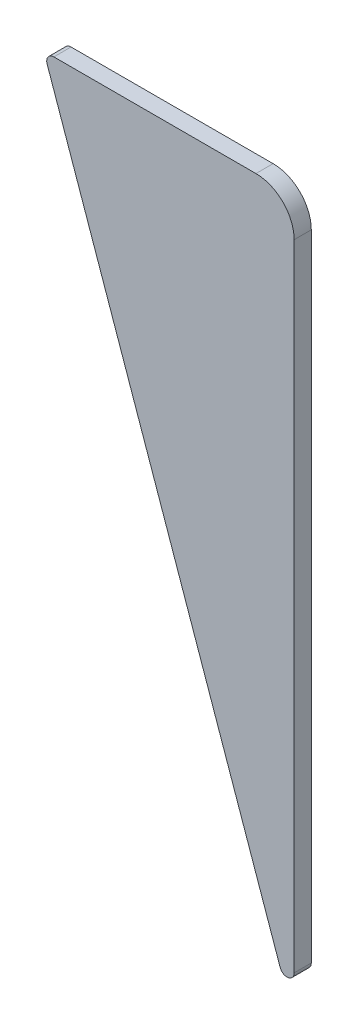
ISO-10303-21;
HEADER;
FILE_DESCRIPTION(('STEP AP214'),'2;1');
FILE_NAME('part.step','',(''),(''),'','','');
FILE_SCHEMA(('AUTOMOTIVE_DESIGN { 1 0 10303 214 1 1 1 1 }'));
ENDSEC;
DATA;
#1=APPLICATION_CONTEXT('core data for automotive mechanical design processes');
#2=APPLICATION_PROTOCOL_DEFINITION('international standard','automotive_design',2000,#1);
#3=PRODUCT_CONTEXT('',#1,'mechanical');
#4=PRODUCT('Part','Part','',(#3));
#5=PRODUCT_RELATED_PRODUCT_CATEGORY('part','',(#4));
#6=PRODUCT_DEFINITION_FORMATION('','',#4);
#7=PRODUCT_DEFINITION_CONTEXT('part definition',#1,'design');
#8=PRODUCT_DEFINITION('design','',#6,#7);
#9=PRODUCT_DEFINITION_SHAPE('','',#8);
#10=(LENGTH_UNIT() NAMED_UNIT(*) SI_UNIT(.MILLI.,.METRE.));
#11=(NAMED_UNIT(*) PLANE_ANGLE_UNIT() SI_UNIT($,.RADIAN.));
#12=(NAMED_UNIT(*) SI_UNIT($,.STERADIAN.) SOLID_ANGLE_UNIT());
#13=UNCERTAINTY_MEASURE_WITH_UNIT(LENGTH_MEASURE(1.E-05),#10,'distance_accuracy_value','');
#14=(GEOMETRIC_REPRESENTATION_CONTEXT(3) GLOBAL_UNCERTAINTY_ASSIGNED_CONTEXT((#13)) GLOBAL_UNIT_ASSIGNED_CONTEXT((#10,
#11,#12)) REPRESENTATION_CONTEXT('',''));
#15=CARTESIAN_POINT('',(0.,0.,0.));
#16=DIRECTION('',(0.,0.,1.));
#17=DIRECTION('',(1.,0.,0.));
#18=AXIS2_PLACEMENT_3D('',#15,#16,#17);
#19=CARTESIAN_POINT('',(0.,-127.,3.048));
#20=DIRECTION('',(-1.,0.,0.));
#21=DIRECTION('',(0.,0.,1.));
#22=AXIS2_PLACEMENT_3D('',#19,#20,#21);
#23=PLANE('',#22);
#24=DIRECTION('',(0.,1.,0.));
#25=VECTOR('',#24,1.);
#26=CARTESIAN_POINT('',(0.,-127.,3.048));
#27=LINE('',#26,#25);
#28=CARTESIAN_POINT('',(0.,-119.527026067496,3.048));
#29=VERTEX_POINT('',#28);
#30=CARTESIAN_POINT('',(0.,-6.7818,3.048));
#31=VERTEX_POINT('',#30);
#32=EDGE_CURVE('E111',#29,#31,#27,.T.);
#33=ORIENTED_EDGE('',*,*,#32,.F.);
#34=DIRECTION('',(0.,0.,-1.));
#35=VECTOR('',#34,1.);
#36=CARTESIAN_POINT('',(0.,-119.527026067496,3.048));
#37=LINE('',#36,#35);
#38=CARTESIAN_POINT('',(0.,-119.527026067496,0.));
#39=VERTEX_POINT('',#38);
#40=EDGE_CURVE('E119',#29,#39,#37,.T.);
#41=ORIENTED_EDGE('',*,*,#40,.T.);
#42=DIRECTION('',(0.,1.,0.));
#43=VECTOR('',#42,1.);
#44=CARTESIAN_POINT('',(0.,-127.,0.));
#45=LINE('',#44,#43);
#46=CARTESIAN_POINT('',(0.,-6.7818,0.));
#47=VERTEX_POINT('',#46);
#48=EDGE_CURVE('E109',#39,#47,#45,.T.);
#49=ORIENTED_EDGE('',*,*,#48,.T.);
#50=DIRECTION('',(0.,0.,-1.));
#51=VECTOR('',#50,1.);
#52=CARTESIAN_POINT('',(0.,-6.7818,3.048));
#53=LINE('',#52,#51);
#54=EDGE_CURVE('E95',#47,#31,#53,.F.);
#55=ORIENTED_EDGE('',*,*,#54,.T.);
#56=EDGE_LOOP('',(#33,#41,#49,#55));
#57=FACE_BOUND('',#56,.T.);
#58=ADVANCED_FACE('F33',(#57),#23,.F.);
#59=CARTESIAN_POINT('',(0.,0.,3.048));
#60=DIRECTION('',(0.,-1.,0.));
#61=DIRECTION('',(1.,0.,0.));
#62=AXIS2_PLACEMENT_3D('',#59,#60,#61);
#63=PLANE('',#62);
#64=DIRECTION('',(-1.,0.,0.));
#65=VECTOR('',#64,1.);
#66=CARTESIAN_POINT('',(0.,0.,0.));
#67=LINE('',#66,#65);
#68=CARTESIAN_POINT('',(-6.7818,0.,0.));
#69=VERTEX_POINT('',#68);
#70=CARTESIAN_POINT('',(-42.6599591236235,0.,0.));
#71=VERTEX_POINT('',#70);
#72=EDGE_CURVE('E101',#69,#71,#67,.T.);
#73=ORIENTED_EDGE('',*,*,#72,.T.);
#74=DIRECTION('',(0.,0.,-1.));
#75=VECTOR('',#74,1.);
#76=CARTESIAN_POINT('',(-42.6599591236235,0.,3.048));
#77=LINE('',#76,#75);
#78=CARTESIAN_POINT('',(-42.6599591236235,0.,3.048));
#79=VERTEX_POINT('',#78);
#80=EDGE_CURVE('E11',#71,#79,#77,.F.);
#81=ORIENTED_EDGE('',*,*,#80,.T.);
#82=DIRECTION('',(-1.,0.,0.));
#83=VECTOR('',#82,1.);
#84=CARTESIAN_POINT('',(0.,0.,3.048));
#85=LINE('',#84,#83);
#86=CARTESIAN_POINT('',(-6.7818,0.,3.048));
#87=VERTEX_POINT('',#86);
#88=EDGE_CURVE('E102',#87,#79,#85,.T.);
#89=ORIENTED_EDGE('',*,*,#88,.F.);
#90=DIRECTION('',(0.,0.,-1.));
#91=VECTOR('',#90,1.);
#92=CARTESIAN_POINT('',(-6.7818,0.,3.048));
#93=LINE('',#92,#91);
#94=EDGE_CURVE('E93',#87,#69,#93,.T.);
#95=ORIENTED_EDGE('',*,*,#94,.T.);
#96=EDGE_LOOP('',(#73,#81,#89,#95));
#97=FACE_BOUND('',#96,.T.);
#98=ADVANCED_FACE('F100',(#97),#63,.F.);
#99=CARTESIAN_POINT('',(-44.45,0.,3.048));
#100=DIRECTION('',(0.943858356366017,0.330350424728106,0.));
#101=DIRECTION('',(-0.330350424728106,0.943858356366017,0.));
#102=AXIS2_PLACEMENT_3D('',#99,#100,#101);
#103=PLANE('',#102);
#104=DIRECTION('',(0.330350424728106,-0.943858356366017,0.));
#105=VECTOR('',#104,1.);
#106=CARTESIAN_POINT('',(-44.45,0.,0.));
#107=LINE('',#106,#105);
#108=CARTESIAN_POINT('',(-43.8586592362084,-1.6895450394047,0.));
#109=VERTEX_POINT('',#108);
#110=CARTESIAN_POINT('',(-2.46870011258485,-119.9465711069,0.));
#111=VERTEX_POINT('',#110);
#112=EDGE_CURVE('E108',#109,#111,#107,.T.);
#113=ORIENTED_EDGE('',*,*,#112,.T.);
#114=DIRECTION('',(0.,0.,-1.));
#115=VECTOR('',#114,1.);
#116=CARTESIAN_POINT('',(-2.46870011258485,-119.9465711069,3.048));
#117=LINE('',#116,#115);
#118=CARTESIAN_POINT('',(-2.46870011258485,-119.9465711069,3.048));
#119=VERTEX_POINT('',#118);
#120=EDGE_CURVE('E54',#111,#119,#117,.F.);
#121=ORIENTED_EDGE('',*,*,#120,.T.);
#122=DIRECTION('',(0.330350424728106,-0.943858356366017,0.));
#123=VECTOR('',#122,1.);
#124=CARTESIAN_POINT('',(-44.45,0.,3.048));
#125=LINE('',#124,#123);
#126=CARTESIAN_POINT('',(-43.8586592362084,-1.6895450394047,3.048));
#127=VERTEX_POINT('',#126);
#128=EDGE_CURVE('E103',#127,#119,#125,.T.);
#129=ORIENTED_EDGE('',*,*,#128,.F.);
#130=DIRECTION('',(0.,0.,-1.));
#131=VECTOR('',#130,1.);
#132=CARTESIAN_POINT('',(-43.8586592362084,-1.6895450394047,3.048));
#133=LINE('',#132,#131);
#134=EDGE_CURVE('E125',#127,#109,#133,.T.);
#135=ORIENTED_EDGE('',*,*,#134,.T.);
#136=EDGE_LOOP('',(#113,#121,#129,#135));
#137=FACE_BOUND('',#136,.T.);
#138=ADVANCED_FACE('F139',(#137),#103,.F.);
#139=CARTESIAN_POINT('',(0.,0.,3.048));
#140=DIRECTION('',(0.,0.,1.));
#141=DIRECTION('',(1.,0.,0.));
#142=AXIS2_PLACEMENT_3D('',#139,#140,#141);
#143=PLANE('',#142);
#144=ORIENTED_EDGE('',*,*,#128,.T.);
#145=CARTESIAN_POINT('',(-1.27,-119.527026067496,3.048));
#146=DIRECTION('',(0.,0.,1.));
#147=DIRECTION('',(1.,0.,0.));
#148=AXIS2_PLACEMENT_3D('',#145,#146,#147);
#149=CIRCLE('',#148,1.27);
#150=EDGE_CURVE('E41',#119,#29,#149,.T.);
#151=ORIENTED_EDGE('',*,*,#150,.T.);
#152=ORIENTED_EDGE('',*,*,#32,.T.);
#153=CARTESIAN_POINT('',(-6.7818,-6.7818,3.048));
#154=DIRECTION('',(0.,0.,1.));
#155=DIRECTION('',(1.,0.,0.));
#156=AXIS2_PLACEMENT_3D('',#153,#154,#155);
#157=CIRCLE('',#156,6.7818);
#158=EDGE_CURVE('E117',#31,#87,#157,.T.);
#159=ORIENTED_EDGE('',*,*,#158,.T.);
#160=ORIENTED_EDGE('',*,*,#88,.T.);
#161=CARTESIAN_POINT('',(-42.6599591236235,-1.27000000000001,3.048));
#162=DIRECTION('',(0.,0.,1.));
#163=DIRECTION('',(1.,0.,0.));
#164=AXIS2_PLACEMENT_3D('',#161,#162,#163);
#165=CIRCLE('',#164,1.27);
#166=EDGE_CURVE('E129',#79,#127,#165,.T.);
#167=ORIENTED_EDGE('',*,*,#166,.T.);
#168=EDGE_LOOP('',(#144,#151,#152,#159,#160,#167));
#169=FACE_BOUND('',#168,.T.);
#170=ADVANCED_FACE('F133',(#169),#143,.T.);
#171=CARTESIAN_POINT('',(0.,0.,0.));
#172=DIRECTION('',(0.,0.,1.));
#173=DIRECTION('',(1.,0.,0.));
#174=AXIS2_PLACEMENT_3D('',#171,#172,#173);
#175=PLANE('',#174);
#176=ORIENTED_EDGE('',*,*,#48,.F.);
#177=CARTESIAN_POINT('',(-1.27,-119.527026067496,0.));
#178=DIRECTION('',(0.,0.,1.));
#179=DIRECTION('',(1.,0.,0.));
#180=AXIS2_PLACEMENT_3D('',#177,#178,#179);
#181=CIRCLE('',#180,1.27);
#182=EDGE_CURVE('E123',#39,#111,#181,.F.);
#183=ORIENTED_EDGE('',*,*,#182,.T.);
#184=ORIENTED_EDGE('',*,*,#112,.F.);
#185=CARTESIAN_POINT('',(-42.6599591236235,-1.27000000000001,0.));
#186=DIRECTION('',(0.,0.,1.));
#187=DIRECTION('',(1.,0.,0.));
#188=AXIS2_PLACEMENT_3D('',#185,#186,#187);
#189=CIRCLE('',#188,1.27);
#190=EDGE_CURVE('E107',#109,#71,#189,.F.);
#191=ORIENTED_EDGE('',*,*,#190,.T.);
#192=ORIENTED_EDGE('',*,*,#72,.F.);
#193=CARTESIAN_POINT('',(-6.7818,-6.7818,0.));
#194=DIRECTION('',(0.,0.,1.));
#195=DIRECTION('',(1.,0.,0.));
#196=AXIS2_PLACEMENT_3D('',#193,#194,#195);
#197=CIRCLE('',#196,6.7818);
#198=EDGE_CURVE('E89',#69,#47,#197,.F.);
#199=ORIENTED_EDGE('',*,*,#198,.T.);
#200=EDGE_LOOP('',(#176,#183,#184,#191,#192,#199));
#201=FACE_BOUND('',#200,.T.);
#202=ADVANCED_FACE('F105',(#201),#175,.F.);
#203=CARTESIAN_POINT('',(-6.7818,-6.7818,3.048));
#204=DIRECTION('',(0.,0.,-1.));
#205=DIRECTION('',(-1.,0.,0.));
#206=AXIS2_PLACEMENT_3D('',#203,#204,#205);
#207=CYLINDRICAL_SURFACE('',#206,6.7818);
#208=ORIENTED_EDGE('',*,*,#158,.F.);
#209=ORIENTED_EDGE('',*,*,#54,.F.);
#210=ORIENTED_EDGE('',*,*,#198,.F.);
#211=ORIENTED_EDGE('',*,*,#94,.F.);
#212=EDGE_LOOP('',(#208,#209,#210,#211));
#213=FACE_BOUND('',#212,.T.);
#214=ADVANCED_FACE('F92',(#213),#207,.T.);
#215=CARTESIAN_POINT('',(-1.27,-119.527026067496,3.048));
#216=DIRECTION('',(0.,0.,-1.));
#217=DIRECTION('',(-1.,0.,0.));
#218=AXIS2_PLACEMENT_3D('',#215,#216,#217);
#219=CYLINDRICAL_SURFACE('',#218,1.27);
#220=ORIENTED_EDGE('',*,*,#150,.F.);
#221=ORIENTED_EDGE('',*,*,#120,.F.);
#222=ORIENTED_EDGE('',*,*,#182,.F.);
#223=ORIENTED_EDGE('',*,*,#40,.F.);
#224=EDGE_LOOP('',(#220,#221,#222,#223));
#225=FACE_BOUND('',#224,.T.);
#226=ADVANCED_FACE('F138',(#225),#219,.T.);
#227=CARTESIAN_POINT('',(-42.6599591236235,-1.27000000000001,3.048));
#228=DIRECTION('',(0.,0.,-1.));
#229=DIRECTION('',(-1.,0.,0.));
#230=AXIS2_PLACEMENT_3D('',#227,#228,#229);
#231=CYLINDRICAL_SURFACE('',#230,1.27);
#232=ORIENTED_EDGE('',*,*,#166,.F.);
#233=ORIENTED_EDGE('',*,*,#80,.F.);
#234=ORIENTED_EDGE('',*,*,#190,.F.);
#235=ORIENTED_EDGE('',*,*,#134,.F.);
#236=EDGE_LOOP('',(#232,#233,#234,#235));
#237=FACE_BOUND('',#236,.T.);
#238=ADVANCED_FACE('F35',(#237),#231,.T.);
#239=CLOSED_SHELL('',(#58,#98,#138,#170,#202,#214,#226,#238));
#240=MANIFOLD_SOLID_BREP('B2',#239);
#241=ADVANCED_BREP_SHAPE_REPRESENTATION('',(#18,#240),#14);
#242=SHAPE_DEFINITION_REPRESENTATION(#9,#241);
ENDSEC;
END-ISO-10303-21;
